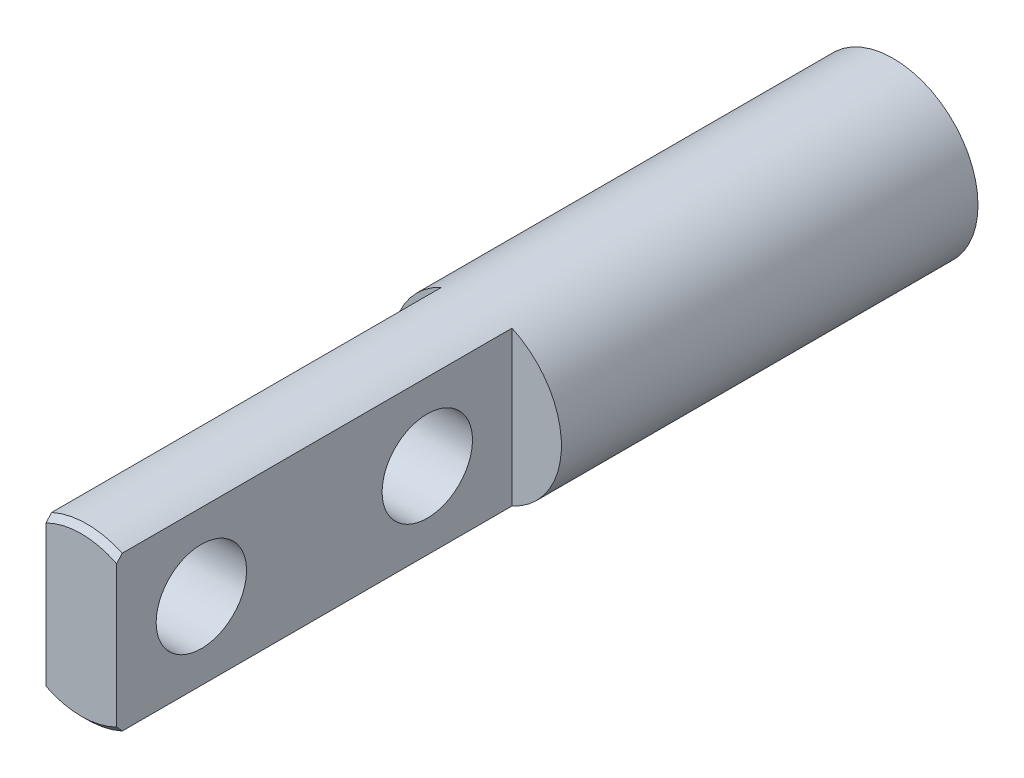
ISO-10303-21;
HEADER;
FILE_DESCRIPTION(('STEP AP214'),'2;1');
FILE_NAME('part.step','',(''),(''),'','','');
FILE_SCHEMA(('AUTOMOTIVE_DESIGN { 1 0 10303 214 1 1 1 1 }'));
ENDSEC;
DATA;
#1=APPLICATION_CONTEXT('core data for automotive mechanical design processes');
#2=APPLICATION_PROTOCOL_DEFINITION('international standard','automotive_design',2000,#1);
#3=PRODUCT_CONTEXT('',#1,'mechanical');
#4=PRODUCT('Part','Part','',(#3));
#5=PRODUCT_RELATED_PRODUCT_CATEGORY('part','',(#4));
#6=PRODUCT_DEFINITION_FORMATION('','',#4);
#7=PRODUCT_DEFINITION_CONTEXT('part definition',#1,'design');
#8=PRODUCT_DEFINITION('design','',#6,#7);
#9=PRODUCT_DEFINITION_SHAPE('','',#8);
#10=(LENGTH_UNIT() NAMED_UNIT(*) SI_UNIT(.MILLI.,.METRE.));
#11=(NAMED_UNIT(*) PLANE_ANGLE_UNIT() SI_UNIT($,.RADIAN.));
#12=(NAMED_UNIT(*) SI_UNIT($,.STERADIAN.) SOLID_ANGLE_UNIT());
#13=UNCERTAINTY_MEASURE_WITH_UNIT(LENGTH_MEASURE(1.E-05),#10,'distance_accuracy_value','');
#14=(GEOMETRIC_REPRESENTATION_CONTEXT(3) GLOBAL_UNCERTAINTY_ASSIGNED_CONTEXT((#13)) GLOBAL_UNIT_ASSIGNED_CONTEXT((#10,
#11,#12)) REPRESENTATION_CONTEXT('',''));
#15=CARTESIAN_POINT('',(0.,0.,0.));
#16=DIRECTION('',(0.,0.,1.));
#17=DIRECTION('',(1.,0.,0.));
#18=AXIS2_PLACEMENT_3D('',#15,#16,#17);
#19=CARTESIAN_POINT('',(0.,0.,14.75));
#20=DIRECTION('',(0.,0.,1.));
#21=DIRECTION('',(1.,0.,0.));
#22=AXIS2_PLACEMENT_3D('',#19,#20,#21);
#23=PLANE('',#22);
#24=DIRECTION('',(0.,-1.,0.));
#25=VECTOR('',#24,1.);
#26=CARTESIAN_POINT('',(-1.25,-2.72717802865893,14.75));
#27=LINE('',#26,#25);
#28=CARTESIAN_POINT('',(-1.25,2.72717802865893,14.75));
#29=VERTEX_POINT('',#28);
#30=CARTESIAN_POINT('',(-1.25,-2.72717802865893,14.75));
#31=VERTEX_POINT('',#30);
#32=EDGE_CURVE('E117',#29,#31,#27,.T.);
#33=ORIENTED_EDGE('',*,*,#32,.F.);
#34=CARTESIAN_POINT('',(0.,0.,14.75));
#35=DIRECTION('',(0.,0.,1.));
#36=DIRECTION('',(1.,0.,0.));
#37=AXIS2_PLACEMENT_3D('',#34,#35,#36);
#38=CIRCLE('',#37,3.);
#39=EDGE_CURVE('E111',#29,#31,#38,.T.);
#40=ORIENTED_EDGE('',*,*,#39,.T.);
#41=EDGE_LOOP('',(#33,#40));
#42=FACE_BOUND('',#41,.T.);
#43=ADVANCED_FACE('F36',(#42),#23,.T.);
#44=CARTESIAN_POINT('',(0.,0.,14.75));
#45=DIRECTION('',(0.,0.,-1.));
#46=DIRECTION('',(-1.,0.,0.));
#47=AXIS2_PLACEMENT_3D('',#44,#45,#46);
#48=CYLINDRICAL_SURFACE('',#47,3.);
#49=DIRECTION('',(0.,0.,-1.));
#50=VECTOR('',#49,1.);
#51=CARTESIAN_POINT('',(1.25,-2.72717802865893,28.75));
#52=LINE('',#51,#50);
#53=CARTESIAN_POINT('',(1.25,-2.72717802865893,28.55));
#54=VERTEX_POINT('',#53);
#55=CARTESIAN_POINT('',(1.25,-2.72717802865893,14.75));
#56=VERTEX_POINT('',#55);
#57=EDGE_CURVE('E103',#54,#56,#52,.T.);
#58=ORIENTED_EDGE('',*,*,#57,.F.);
#59=CARTESIAN_POINT('',(0.,0.,28.55));
#60=DIRECTION('',(0.,0.,1.));
#61=DIRECTION('',(1.,0.,0.));
#62=AXIS2_PLACEMENT_3D('',#59,#60,#61);
#63=CIRCLE('',#62,3.);
#64=CARTESIAN_POINT('',(-1.25,-2.72717802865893,28.55));
#65=VERTEX_POINT('',#64);
#66=EDGE_CURVE('E56',#54,#65,#63,.F.);
#67=ORIENTED_EDGE('',*,*,#66,.T.);
#68=DIRECTION('',(0.,0.,-1.));
#69=VECTOR('',#68,1.);
#70=CARTESIAN_POINT('',(-1.25,-2.72717802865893,28.75));
#71=LINE('',#70,#69);
#72=EDGE_CURVE('E150',#65,#31,#71,.T.);
#73=ORIENTED_EDGE('',*,*,#72,.T.);
#74=ORIENTED_EDGE('',*,*,#39,.F.);
#75=DIRECTION('',(0.,0.,-1.));
#76=VECTOR('',#75,1.);
#77=CARTESIAN_POINT('',(-1.25,2.72717802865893,28.75));
#78=LINE('',#77,#76);
#79=CARTESIAN_POINT('',(-1.25,2.72717802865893,28.55));
#80=VERTEX_POINT('',#79);
#81=EDGE_CURVE('E104',#80,#29,#78,.T.);
#82=ORIENTED_EDGE('',*,*,#81,.F.);
#83=CARTESIAN_POINT('',(0.,0.,28.55));
#84=DIRECTION('',(0.,0.,1.));
#85=DIRECTION('',(1.,0.,0.));
#86=AXIS2_PLACEMENT_3D('',#83,#84,#85);
#87=CIRCLE('',#86,3.);
#88=CARTESIAN_POINT('',(1.25,2.72717802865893,28.55));
#89=VERTEX_POINT('',#88);
#90=EDGE_CURVE('E98',#80,#89,#87,.F.);
#91=ORIENTED_EDGE('',*,*,#90,.T.);
#92=DIRECTION('',(0.,0.,-1.));
#93=VECTOR('',#92,1.);
#94=CARTESIAN_POINT('',(1.25,2.72717802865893,28.75));
#95=LINE('',#94,#93);
#96=CARTESIAN_POINT('',(1.25,2.72717802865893,14.75));
#97=VERTEX_POINT('',#96);
#98=EDGE_CURVE('E92',#89,#97,#95,.T.);
#99=ORIENTED_EDGE('',*,*,#98,.T.);
#100=EDGE_CURVE('E96',#56,#97,#38,.T.);
#101=ORIENTED_EDGE('',*,*,#100,.F.);
#102=EDGE_LOOP('',(#58,#67,#73,#74,#82,#91,#99,#101));
#103=FACE_BOUND('',#102,.T.);
#104=CARTESIAN_POINT('',(0.,0.,0.));
#105=DIRECTION('',(0.,0.,1.));
#106=DIRECTION('',(1.,0.,0.));
#107=AXIS2_PLACEMENT_3D('',#104,#105,#106);
#108=CIRCLE('',#107,3.);
#109=CARTESIAN_POINT('',(3.,0.,0.));
#110=VERTEX_POINT('',#109);
#111=EDGE_CURVE('E112',#110,#110,#108,.T.);
#112=ORIENTED_EDGE('',*,*,#111,.T.);
#113=EDGE_LOOP('',(#112));
#114=FACE_BOUND('',#113,.T.);
#115=ADVANCED_FACE('F94',(#103,#114),#48,.T.);
#116=DIRECTION('',(0.,1.,0.));
#117=VECTOR('',#116,1.);
#118=CARTESIAN_POINT('',(1.25,-2.72717802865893,14.75));
#119=LINE('',#118,#117);
#120=EDGE_CURVE('E109',#56,#97,#119,.T.);
#121=ORIENTED_EDGE('',*,*,#120,.F.);
#122=ORIENTED_EDGE('',*,*,#100,.T.);
#123=EDGE_LOOP('',(#121,#122));
#124=FACE_BOUND('',#123,.T.);
#125=ADVANCED_FACE('F108',(#124),#23,.T.);
#126=CARTESIAN_POINT('',(0.,0.,0.));
#127=DIRECTION('',(0.,0.,1.));
#128=DIRECTION('',(1.,0.,0.));
#129=AXIS2_PLACEMENT_3D('',#126,#127,#128);
#130=PLANE('',#129);
#131=ORIENTED_EDGE('',*,*,#111,.F.);
#132=EDGE_LOOP('',(#131));
#133=FACE_BOUND('',#132,.T.);
#134=ADVANCED_FACE('F172',(#133),#130,.F.);
#135=CARTESIAN_POINT('',(1.25,-2.72717802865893,28.75));
#136=DIRECTION('',(-1.,0.,0.));
#137=DIRECTION('',(0.,0.,1.));
#138=AXIS2_PLACEMENT_3D('',#135,#136,#137);
#139=PLANE('',#138);
#140=CARTESIAN_POINT('',(1.25,0.,17.75));
#141=DIRECTION('',(-1.,0.,0.));
#142=DIRECTION('',(0.,0.,1.));
#143=AXIS2_PLACEMENT_3D('',#140,#141,#142);
#144=CIRCLE('',#143,1.6);
#145=CARTESIAN_POINT('',(1.25,0.,19.35));
#146=VERTEX_POINT('',#145);
#147=EDGE_CURVE('E224',#146,#146,#144,.F.);
#148=ORIENTED_EDGE('',*,*,#147,.F.);
#149=EDGE_LOOP('',(#148));
#150=FACE_BOUND('',#149,.T.);
#151=CARTESIAN_POINT('',(1.25,0.,25.75));
#152=DIRECTION('',(-1.,0.,0.));
#153=DIRECTION('',(0.,0.,1.));
#154=AXIS2_PLACEMENT_3D('',#151,#152,#153);
#155=CIRCLE('',#154,1.6);
#156=CARTESIAN_POINT('',(1.25,0.,27.35));
#157=VERTEX_POINT('',#156);
#158=EDGE_CURVE('E118',#157,#157,#155,.F.);
#159=ORIENTED_EDGE('',*,*,#158,.F.);
#160=EDGE_LOOP('',(#159));
#161=FACE_BOUND('',#160,.T.);
#162=DIRECTION('',(0.,1.,0.));
#163=VECTOR('',#162,1.);
#164=CARTESIAN_POINT('',(1.25,-2.72717802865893,28.75));
#165=LINE('',#164,#163);
#166=CARTESIAN_POINT('',(1.25,-2.50549396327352,28.75));
#167=VERTEX_POINT('',#166);
#168=CARTESIAN_POINT('',(1.25,2.50549396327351,28.75));
#169=VERTEX_POINT('',#168);
#170=EDGE_CURVE('E124',#167,#169,#165,.T.);
#171=ORIENTED_EDGE('',*,*,#170,.F.);
#172=CARTESIAN_POINT('',(1.25,-2.50549396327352,28.75));
#173=CARTESIAN_POINT('',(1.25,-2.54257199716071,28.7168115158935));
#174=CARTESIAN_POINT('',(1.25,-2.57958468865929,28.6835506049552));
#175=CARTESIAN_POINT('',(1.25,-2.65347937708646,28.6168839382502));
#176=CARTESIAN_POINT('',(1.25,-2.69036137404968,28.5834781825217));
#177=CARTESIAN_POINT('',(1.25,-2.72717802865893,28.55));
#178=B_SPLINE_CURVE_WITH_KNOTS('',3,(#172,#173,#174,#175,#176,#177),.UNSPECIFIED.,.F.,.F.,(4,2,
4),(0.,0.149285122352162,0.298570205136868),.UNSPECIFIED.);
#179=EDGE_CURVE('E156',#167,#54,#178,.T.);
#180=ORIENTED_EDGE('',*,*,#179,.T.);
#181=ORIENTED_EDGE('',*,*,#57,.T.);
#182=ORIENTED_EDGE('',*,*,#120,.T.);
#183=ORIENTED_EDGE('',*,*,#98,.F.);
#184=CARTESIAN_POINT('',(1.25,2.72717802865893,28.55));
#185=CARTESIAN_POINT('',(1.25,2.69036137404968,28.5834781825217));
#186=CARTESIAN_POINT('',(1.25,2.65347937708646,28.6168839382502));
#187=CARTESIAN_POINT('',(1.25,2.57958468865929,28.6835506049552));
#188=CARTESIAN_POINT('',(1.25,2.54257199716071,28.7168115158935));
#189=CARTESIAN_POINT('',(1.25,2.50549396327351,28.75));
#190=B_SPLINE_CURVE_WITH_KNOTS('',3,(#184,#185,#186,#187,#188,#189),.UNSPECIFIED.,.F.,.F.,(4,2,
4),(0.,0.14928508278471,0.298570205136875),.UNSPECIFIED.);
#191=EDGE_CURVE('E177',#89,#169,#190,.T.);
#192=ORIENTED_EDGE('',*,*,#191,.T.);
#193=EDGE_LOOP('',(#171,#180,#181,#182,#183,#192));
#194=FACE_BOUND('',#193,.T.);
#195=ADVANCED_FACE('F115',(#150,#161,#194),#139,.F.);
#196=CARTESIAN_POINT('',(-1.25,-2.72717802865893,28.75));
#197=DIRECTION('',(1.,0.,0.));
#198=DIRECTION('',(0.,0.,-1.));
#199=AXIS2_PLACEMENT_3D('',#196,#197,#198);
#200=PLANE('',#199);
#201=CARTESIAN_POINT('',(-1.25,0.,17.75));
#202=DIRECTION('',(-1.,0.,0.));
#203=DIRECTION('',(0.,0.,1.));
#204=AXIS2_PLACEMENT_3D('',#201,#202,#203);
#205=CIRCLE('',#204,1.6);
#206=CARTESIAN_POINT('',(-1.25,0.,19.35));
#207=VERTEX_POINT('',#206);
#208=EDGE_CURVE('E222',#207,#207,#205,.T.);
#209=ORIENTED_EDGE('',*,*,#208,.F.);
#210=EDGE_LOOP('',(#209));
#211=FACE_BOUND('',#210,.T.);
#212=CARTESIAN_POINT('',(-1.25,0.,25.75));
#213=DIRECTION('',(-1.,0.,0.));
#214=DIRECTION('',(0.,0.,1.));
#215=AXIS2_PLACEMENT_3D('',#212,#213,#214);
#216=CIRCLE('',#215,1.6);
#217=CARTESIAN_POINT('',(-1.25,0.,27.35));
#218=VERTEX_POINT('',#217);
#219=EDGE_CURVE('E128',#218,#218,#216,.T.);
#220=ORIENTED_EDGE('',*,*,#219,.F.);
#221=EDGE_LOOP('',(#220));
#222=FACE_BOUND('',#221,.T.);
#223=ORIENTED_EDGE('',*,*,#72,.F.);
#224=CARTESIAN_POINT('',(-1.25,-2.72717802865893,28.55));
#225=CARTESIAN_POINT('',(-1.25,-2.69036137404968,28.5834781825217));
#226=CARTESIAN_POINT('',(-1.25,-2.65347937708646,28.6168839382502));
#227=CARTESIAN_POINT('',(-1.25,-2.57958468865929,28.6835506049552));
#228=CARTESIAN_POINT('',(-1.25,-2.54257199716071,28.7168115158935));
#229=CARTESIAN_POINT('',(-1.25,-2.50549396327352,28.75));
#230=B_SPLINE_CURVE_WITH_KNOTS('',3,(#224,#225,#226,#227,#228,#229),.UNSPECIFIED.,.F.,.F.,(4,2,
4),(0.,0.149285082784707,0.298570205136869),.UNSPECIFIED.);
#231=CARTESIAN_POINT('',(-1.25,-2.50549396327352,28.75));
#232=VERTEX_POINT('',#231);
#233=EDGE_CURVE('E11',#65,#232,#230,.T.);
#234=ORIENTED_EDGE('',*,*,#233,.T.);
#235=DIRECTION('',(0.,-1.,0.));
#236=VECTOR('',#235,1.);
#237=CARTESIAN_POINT('',(-1.25,-2.72717802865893,28.75));
#238=LINE('',#237,#236);
#239=CARTESIAN_POINT('',(-1.25,2.50549396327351,28.75));
#240=VERTEX_POINT('',#239);
#241=EDGE_CURVE('E139',#240,#232,#238,.T.);
#242=ORIENTED_EDGE('',*,*,#241,.F.);
#243=CARTESIAN_POINT('',(-1.25,2.50549396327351,28.75));
#244=CARTESIAN_POINT('',(-1.25,2.54257199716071,28.7168115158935));
#245=CARTESIAN_POINT('',(-1.25,2.57958468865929,28.6835506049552));
#246=CARTESIAN_POINT('',(-1.25,2.65347937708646,28.6168839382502));
#247=CARTESIAN_POINT('',(-1.25,2.69036137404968,28.5834781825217));
#248=CARTESIAN_POINT('',(-1.25,2.72717802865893,28.55));
#249=B_SPLINE_CURVE_WITH_KNOTS('',3,(#243,#244,#245,#246,#247,#248),.UNSPECIFIED.,.F.,.F.,(4,2,
4),(0.,0.149285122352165,0.298570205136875),.UNSPECIFIED.);
#250=EDGE_CURVE('E49',#240,#80,#249,.T.);
#251=ORIENTED_EDGE('',*,*,#250,.T.);
#252=ORIENTED_EDGE('',*,*,#81,.T.);
#253=ORIENTED_EDGE('',*,*,#32,.T.);
#254=EDGE_LOOP('',(#223,#234,#242,#251,#252,#253));
#255=FACE_BOUND('',#254,.T.);
#256=ADVANCED_FACE('F160',(#211,#222,#255),#200,.F.);
#257=CARTESIAN_POINT('',(0.,0.,28.75));
#258=DIRECTION('',(0.,0.,1.));
#259=DIRECTION('',(1.,0.,0.));
#260=AXIS2_PLACEMENT_3D('',#257,#258,#259);
#261=PLANE('',#260);
#262=ORIENTED_EDGE('',*,*,#241,.T.);
#263=CARTESIAN_POINT('',(0.,0.,28.75));
#264=DIRECTION('',(0.,0.,1.));
#265=DIRECTION('',(1.,0.,0.));
#266=AXIS2_PLACEMENT_3D('',#263,#264,#265);
#267=CIRCLE('',#266,2.80000000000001);
#268=EDGE_CURVE('E209',#232,#167,#267,.T.);
#269=ORIENTED_EDGE('',*,*,#268,.T.);
#270=ORIENTED_EDGE('',*,*,#170,.T.);
#271=CARTESIAN_POINT('',(0.,0.,28.75));
#272=DIRECTION('',(0.,0.,1.));
#273=DIRECTION('',(1.,0.,0.));
#274=AXIS2_PLACEMENT_3D('',#271,#272,#273);
#275=CIRCLE('',#274,2.8);
#276=EDGE_CURVE('E207',#169,#240,#275,.T.);
#277=ORIENTED_EDGE('',*,*,#276,.T.);
#278=EDGE_LOOP('',(#262,#269,#270,#277));
#279=FACE_BOUND('',#278,.T.);
#280=ADVANCED_FACE('F165',(#279),#261,.T.);
#281=CARTESIAN_POINT('',(5.77548339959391,0.,25.75));
#282=DIRECTION('',(-1.,0.,0.));
#283=DIRECTION('',(0.,0.,1.));
#284=AXIS2_PLACEMENT_3D('',#281,#282,#283);
#285=CYLINDRICAL_SURFACE('',#284,1.6);
#286=ORIENTED_EDGE('',*,*,#158,.T.);
#287=EDGE_LOOP('',(#286));
#288=FACE_BOUND('',#287,.T.);
#289=ORIENTED_EDGE('',*,*,#219,.T.);
#290=EDGE_LOOP('',(#289));
#291=FACE_BOUND('',#290,.T.);
#292=ADVANCED_FACE('F252',(#288,#291),#285,.F.);
#293=CARTESIAN_POINT('',(5.77548339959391,0.,17.75));
#294=DIRECTION('',(-1.,0.,0.));
#295=DIRECTION('',(0.,0.,1.));
#296=AXIS2_PLACEMENT_3D('',#293,#294,#295);
#297=CYLINDRICAL_SURFACE('',#296,1.6);
#298=ORIENTED_EDGE('',*,*,#147,.T.);
#299=EDGE_LOOP('',(#298));
#300=FACE_BOUND('',#299,.T.);
#301=ORIENTED_EDGE('',*,*,#208,.T.);
#302=EDGE_LOOP('',(#301));
#303=FACE_BOUND('',#302,.T.);
#304=ADVANCED_FACE('F189',(#300,#303),#297,.F.);
#305=CARTESIAN_POINT('',(0.,0.,28.75));
#306=DIRECTION('',(0.,0.,-1.));
#307=DIRECTION('',(-1.,0.,0.));
#308=AXIS2_PLACEMENT_3D('',#305,#306,#307);
#309=CONICAL_SURFACE('',#308,2.80000000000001,0.78539816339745);
#310=ORIENTED_EDGE('',*,*,#233,.F.);
#311=ORIENTED_EDGE('',*,*,#66,.F.);
#312=ORIENTED_EDGE('',*,*,#179,.F.);
#313=ORIENTED_EDGE('',*,*,#268,.F.);
#314=EDGE_LOOP('',(#310,#311,#312,#313));
#315=FACE_BOUND('',#314,.T.);
#316=ADVANCED_FACE('F185',(#315),#309,.T.);
#317=CARTESIAN_POINT('',(0.,0.,28.75));
#318=DIRECTION('',(0.,0.,-1.));
#319=DIRECTION('',(-1.,0.,0.));
#320=AXIS2_PLACEMENT_3D('',#317,#318,#319);
#321=CONICAL_SURFACE('',#320,2.8,0.78539816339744);
#322=ORIENTED_EDGE('',*,*,#191,.F.);
#323=ORIENTED_EDGE('',*,*,#90,.F.);
#324=ORIENTED_EDGE('',*,*,#250,.F.);
#325=ORIENTED_EDGE('',*,*,#276,.F.);
#326=EDGE_LOOP('',(#322,#323,#324,#325));
#327=FACE_BOUND('',#326,.T.);
#328=ADVANCED_FACE('F38',(#327),#321,.T.);
#329=CLOSED_SHELL('',(#43,#115,#125,#134,#195,#256,#280,#292,#304,#316,#328));
#330=MANIFOLD_SOLID_BREP('B2',#329);
#331=ADVANCED_BREP_SHAPE_REPRESENTATION('',(#18,#330),#14);
#332=SHAPE_DEFINITION_REPRESENTATION(#9,#331);
ENDSEC;
END-ISO-10303-21;
